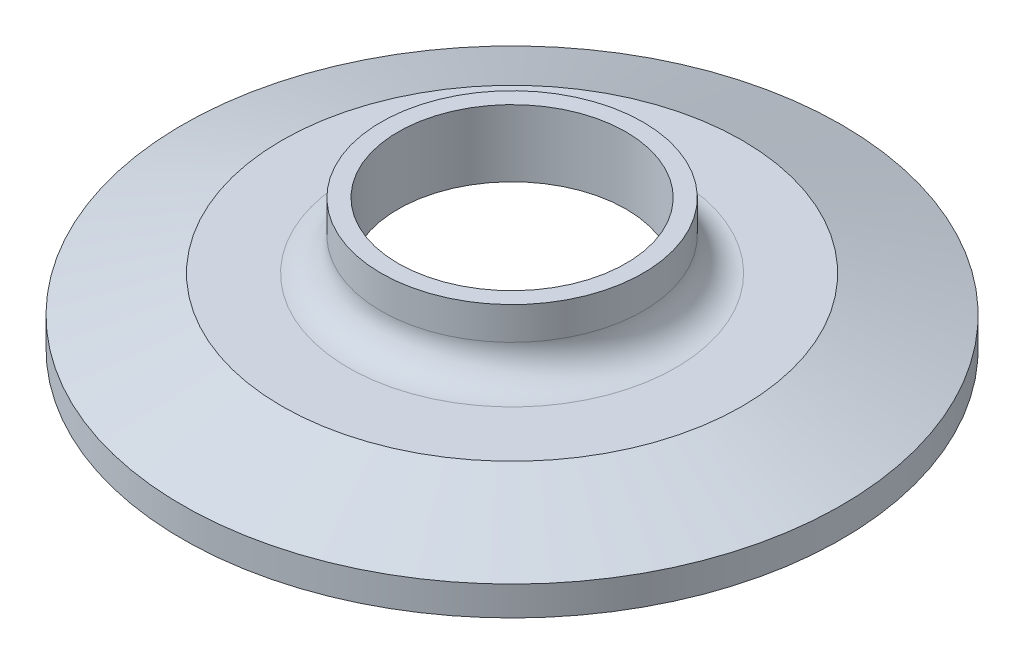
ISO-10303-21;
HEADER;
FILE_DESCRIPTION(('STEP AP214'),'2;1');
FILE_NAME('part.step','',(''),(''),'','','');
FILE_SCHEMA(('AUTOMOTIVE_DESIGN { 1 0 10303 214 1 1 1 1 }'));
ENDSEC;
DATA;
#1=APPLICATION_CONTEXT('core data for automotive mechanical design processes');
#2=APPLICATION_PROTOCOL_DEFINITION('international standard','automotive_design',2000,#1);
#3=PRODUCT_CONTEXT('',#1,'mechanical');
#4=PRODUCT('Part','Part','',(#3));
#5=PRODUCT_RELATED_PRODUCT_CATEGORY('part','',(#4));
#6=PRODUCT_DEFINITION_FORMATION('','',#4);
#7=PRODUCT_DEFINITION_CONTEXT('part definition',#1,'design');
#8=PRODUCT_DEFINITION('design','',#6,#7);
#9=PRODUCT_DEFINITION_SHAPE('','',#8);
#10=(LENGTH_UNIT() NAMED_UNIT(*) SI_UNIT(.MILLI.,.METRE.));
#11=(NAMED_UNIT(*) PLANE_ANGLE_UNIT() SI_UNIT($,.RADIAN.));
#12=(NAMED_UNIT(*) SI_UNIT($,.STERADIAN.) SOLID_ANGLE_UNIT());
#13=UNCERTAINTY_MEASURE_WITH_UNIT(LENGTH_MEASURE(1.E-05),#10,'distance_accuracy_value','');
#14=(GEOMETRIC_REPRESENTATION_CONTEXT(3) GLOBAL_UNCERTAINTY_ASSIGNED_CONTEXT((#13)) GLOBAL_UNIT_ASSIGNED_CONTEXT((#10,
#11,#12)) REPRESENTATION_CONTEXT('',''));
#15=CARTESIAN_POINT('',(0.,0.,0.));
#16=DIRECTION('',(0.,0.,1.));
#17=DIRECTION('',(1.,0.,0.));
#18=AXIS2_PLACEMENT_3D('',#15,#16,#17);
#19=CARTESIAN_POINT('',(-11.049,12.7,0.));
#20=DIRECTION('',(0.,-1.,0.));
#21=DIRECTION('',(0.,0.,-1.));
#22=AXIS2_PLACEMENT_3D('',#19,#20,#21);
#23=PLANE('',#22);
#24=CARTESIAN_POINT('',(0.,12.7,0.));
#25=DIRECTION('',(0.,-1.,0.));
#26=DIRECTION('',(0.,0.,-1.));
#27=AXIS2_PLACEMENT_3D('',#24,#25,#26);
#28=CIRCLE('',#27,12.7);
#29=CARTESIAN_POINT('',(0.,12.7,-12.7));
#30=VERTEX_POINT('',#29);
#31=EDGE_CURVE('E12',#30,#30,#28,.T.);
#32=ORIENTED_EDGE('',*,*,#31,.F.);
#33=EDGE_LOOP('',(#32));
#34=FACE_BOUND('',#33,.T.);
#35=CARTESIAN_POINT('',(0.,12.7,0.));
#36=DIRECTION('',(0.,-1.,0.));
#37=DIRECTION('',(0.,0.,-1.));
#38=AXIS2_PLACEMENT_3D('',#35,#36,#37);
#39=CIRCLE('',#38,11.049);
#40=CARTESIAN_POINT('',(0.,12.7,-11.049));
#41=VERTEX_POINT('',#40);
#42=EDGE_CURVE('E87',#41,#41,#39,.T.);
#43=ORIENTED_EDGE('',*,*,#42,.T.);
#44=EDGE_LOOP('',(#43));
#45=FACE_BOUND('',#44,.T.);
#46=ADVANCED_FACE('F38',(#34,#45),#23,.F.);
#47=CARTESIAN_POINT('',(0.,0.,0.));
#48=DIRECTION('',(0.,-1.,0.));
#49=DIRECTION('',(0.,0.,-1.));
#50=AXIS2_PLACEMENT_3D('',#47,#48,#49);
#51=CYLINDRICAL_SURFACE('',#50,12.7);
#52=CARTESIAN_POINT('',(0.,9.52500000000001,0.));
#53=DIRECTION('',(0.,-1.,0.));
#54=DIRECTION('',(0.,0.,-1.));
#55=AXIS2_PLACEMENT_3D('',#52,#53,#54);
#56=CIRCLE('',#55,12.7);
#57=CARTESIAN_POINT('',(0.,9.525,-12.7));
#58=VERTEX_POINT('',#57);
#59=EDGE_CURVE('E44',#58,#58,#56,.T.);
#60=ORIENTED_EDGE('',*,*,#59,.F.);
#61=EDGE_LOOP('',(#60));
#62=FACE_BOUND('',#61,.T.);
#63=ORIENTED_EDGE('',*,*,#31,.T.);
#64=EDGE_LOOP('',(#63));
#65=FACE_BOUND('',#64,.T.);
#66=ADVANCED_FACE('F166',(#62,#65),#51,.T.);
#67=CARTESIAN_POINT('',(0.,9.52500000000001,0.));
#68=DIRECTION('',(0.,-1.,0.));
#69=DIRECTION('',(0.,0.,-1.));
#70=AXIS2_PLACEMENT_3D('',#67,#68,#69);
#71=TOROIDAL_SURFACE('',#70,15.875,3.175);
#72=CARTESIAN_POINT('',(0.,6.34999999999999,0.));
#73=DIRECTION('',(0.,-1.,0.));
#74=DIRECTION('',(0.,0.,-1.));
#75=AXIS2_PLACEMENT_3D('',#72,#73,#74);
#76=CIRCLE('',#75,15.875);
#77=CARTESIAN_POINT('',(0.,6.34999999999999,-15.875));
#78=VERTEX_POINT('',#77);
#79=EDGE_CURVE('E48',#78,#78,#76,.T.);
#80=ORIENTED_EDGE('',*,*,#79,.F.);
#81=EDGE_LOOP('',(#80));
#82=FACE_BOUND('',#81,.T.);
#83=ORIENTED_EDGE('',*,*,#59,.T.);
#84=EDGE_LOOP('',(#83));
#85=FACE_BOUND('',#84,.T.);
#86=ADVANCED_FACE('F161',(#82,#85),#71,.F.);
#87=CARTESIAN_POINT('',(-15.875,6.34999999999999,0.));
#88=DIRECTION('',(0.,-1.,0.));
#89=DIRECTION('',(0.,0.,-1.));
#90=AXIS2_PLACEMENT_3D('',#87,#88,#89);
#91=PLANE('',#90);
#92=CARTESIAN_POINT('',(0.,6.34999999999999,0.));
#93=DIRECTION('',(0.,-1.,0.));
#94=DIRECTION('',(0.,0.,-1.));
#95=AXIS2_PLACEMENT_3D('',#92,#93,#94);
#96=CIRCLE('',#95,22.3227421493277);
#97=CARTESIAN_POINT('',(0.,6.34999999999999,-22.3227421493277));
#98=VERTEX_POINT('',#97);
#99=EDGE_CURVE('E52',#98,#98,#96,.T.);
#100=ORIENTED_EDGE('',*,*,#99,.F.);
#101=EDGE_LOOP('',(#100));
#102=FACE_BOUND('',#101,.T.);
#103=ORIENTED_EDGE('',*,*,#79,.T.);
#104=EDGE_LOOP('',(#103));
#105=FACE_BOUND('',#104,.T.);
#106=ADVANCED_FACE('F155',(#102,#105),#91,.F.);
#107=CARTESIAN_POINT('',(0.,6.34999999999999,0.));
#108=DIRECTION('',(0.,-1.,0.));
#109=DIRECTION('',(0.,0.,-1.));
#110=AXIS2_PLACEMENT_3D('',#107,#108,#109);
#111=CONICAL_SURFACE('',#110,22.3227421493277,1.22173047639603);
#112=CARTESIAN_POINT('',(0.,2.84479999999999,0.));
#113=DIRECTION('',(0.,-1.,0.));
#114=DIRECTION('',(0.,0.,-1.));
#115=AXIS2_PLACEMENT_3D('',#112,#113,#114);
#116=CIRCLE('',#115,31.9532);
#117=CARTESIAN_POINT('',(0.,2.84479999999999,-31.9532));
#118=VERTEX_POINT('',#117);
#119=EDGE_CURVE('E57',#118,#118,#116,.T.);
#120=ORIENTED_EDGE('',*,*,#119,.F.);
#121=EDGE_LOOP('',(#120));
#122=FACE_BOUND('',#121,.T.);
#123=ORIENTED_EDGE('',*,*,#99,.T.);
#124=EDGE_LOOP('',(#123));
#125=FACE_BOUND('',#124,.T.);
#126=ADVANCED_FACE('F149',(#122,#125),#111,.T.);
#127=CARTESIAN_POINT('',(0.,0.,0.));
#128=DIRECTION('',(0.,-1.,0.));
#129=DIRECTION('',(0.,0.,-1.));
#130=AXIS2_PLACEMENT_3D('',#127,#128,#129);
#131=CYLINDRICAL_SURFACE('',#130,31.9532);
#132=CARTESIAN_POINT('',(0.,0.,0.));
#133=DIRECTION('',(0.,-1.,0.));
#134=DIRECTION('',(0.,0.,-1.));
#135=AXIS2_PLACEMENT_3D('',#132,#133,#134);
#136=CIRCLE('',#135,31.9532);
#137=CARTESIAN_POINT('',(0.,0.,-31.9532));
#138=VERTEX_POINT('',#137);
#139=EDGE_CURVE('E60',#138,#138,#136,.T.);
#140=ORIENTED_EDGE('',*,*,#139,.F.);
#141=EDGE_LOOP('',(#140));
#142=FACE_BOUND('',#141,.T.);
#143=ORIENTED_EDGE('',*,*,#119,.T.);
#144=EDGE_LOOP('',(#143));
#145=FACE_BOUND('',#144,.T.);
#146=ADVANCED_FACE('F143',(#142,#145),#131,.T.);
#147=CARTESIAN_POINT('',(0.,0.,0.));
#148=DIRECTION('',(0.,-1.,0.));
#149=DIRECTION('',(0.,0.,-1.));
#150=AXIS2_PLACEMENT_3D('',#147,#148,#149);
#151=CONICAL_SURFACE('',#150,31.9532,1.56939586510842);
#152=CARTESIAN_POINT('',(0.,0.0025124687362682,0.));
#153=DIRECTION('',(0.,-1.,0.));
#154=DIRECTION('',(0.,0.,-1.));
#155=AXIS2_PLACEMENT_3D('',#152,#153,#154);
#156=CIRCLE('',#155,30.1591722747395);
#157=CARTESIAN_POINT('',(0.,0.00251246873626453,-30.1591722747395));
#158=VERTEX_POINT('',#157);
#159=EDGE_CURVE('E63',#158,#158,#156,.T.);
#160=ORIENTED_EDGE('',*,*,#159,.F.);
#161=EDGE_LOOP('',(#160));
#162=FACE_BOUND('',#161,.T.);
#163=ORIENTED_EDGE('',*,*,#139,.T.);
#164=EDGE_LOOP('',(#163));
#165=FACE_BOUND('',#164,.T.);
#166=ADVANCED_FACE('F137',(#162,#165),#151,.F.);
#167=CARTESIAN_POINT('',(0.,0.789912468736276,0.));
#168=DIRECTION('',(0.,-1.,0.));
#169=DIRECTION('',(0.,0.,-1.));
#170=AXIS2_PLACEMENT_3D('',#167,#168,#169);
#171=TOROIDAL_SURFACE('',#170,30.1591722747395,0.787400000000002);
#172=CARTESIAN_POINT('',(0.,0.482250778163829,0.));
#173=DIRECTION('',(0.,-1.,0.));
#174=DIRECTION('',(0.,0.,-1.));
#175=AXIS2_PLACEMENT_3D('',#172,#173,#174);
#176=CIRCLE('',#175,29.434366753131);
#177=CARTESIAN_POINT('',(0.,0.482250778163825,-29.434366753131));
#178=VERTEX_POINT('',#177);
#179=EDGE_CURVE('E66',#178,#178,#176,.T.);
#180=ORIENTED_EDGE('',*,*,#179,.F.);
#181=EDGE_LOOP('',(#180));
#182=FACE_BOUND('',#181,.T.);
#183=ORIENTED_EDGE('',*,*,#159,.T.);
#184=EDGE_LOOP('',(#183));
#185=FACE_BOUND('',#184,.T.);
#186=ADVANCED_FACE('F131',(#182,#185),#171,.T.);
#187=CARTESIAN_POINT('',(0.,0.482250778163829,0.));
#188=DIRECTION('',(0.,-1.,0.));
#189=DIRECTION('',(0.,0.,-1.));
#190=AXIS2_PLACEMENT_3D('',#187,#188,#189);
#191=CONICAL_SURFACE('',#190,29.434366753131,0.401425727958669);
#192=CARTESIAN_POINT('',(0.,0.875367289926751,0.));
#193=DIRECTION('',(0.,-1.,0.));
#194=DIRECTION('',(0.,0.,-1.));
#195=AXIS2_PLACEMENT_3D('',#192,#193,#194);
#196=CIRCLE('',#195,29.2674986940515);
#197=CARTESIAN_POINT('',(0.,0.875367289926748,-29.2674986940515));
#198=VERTEX_POINT('',#197);
#199=EDGE_CURVE('E69',#198,#198,#196,.T.);
#200=ORIENTED_EDGE('',*,*,#199,.F.);
#201=EDGE_LOOP('',(#200));
#202=FACE_BOUND('',#201,.T.);
#203=ORIENTED_EDGE('',*,*,#179,.T.);
#204=EDGE_LOOP('',(#203));
#205=FACE_BOUND('',#204,.T.);
#206=ADVANCED_FACE('F125',(#202,#205),#191,.F.);
#207=CARTESIAN_POINT('',(0.,0.408912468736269,0.));
#208=DIRECTION('',(0.,-1.,0.));
#209=DIRECTION('',(0.,0.,-1.));
#210=AXIS2_PLACEMENT_3D('',#207,#208,#209);
#211=TOROIDAL_SURFACE('',#210,28.1686,1.1938);
#212=CARTESIAN_POINT('',(0.,0.875367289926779,0.));
#213=DIRECTION('',(0.,-1.,0.));
#214=DIRECTION('',(0.,0.,-1.));
#215=AXIS2_PLACEMENT_3D('',#212,#213,#214);
#216=CIRCLE('',#215,27.0697013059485);
#217=CARTESIAN_POINT('',(0.,0.875367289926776,-27.0697013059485));
#218=VERTEX_POINT('',#217);
#219=EDGE_CURVE('E72',#218,#218,#216,.T.);
#220=ORIENTED_EDGE('',*,*,#219,.F.);
#221=EDGE_LOOP('',(#220));
#222=FACE_BOUND('',#221,.T.);
#223=ORIENTED_EDGE('',*,*,#199,.T.);
#224=EDGE_LOOP('',(#223));
#225=FACE_BOUND('',#224,.T.);
#226=ADVANCED_FACE('F119',(#222,#225),#211,.F.);
#227=CARTESIAN_POINT('',(0.,0.875367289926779,0.));
#228=DIRECTION('',(0.,1.,0.));
#229=DIRECTION('',(0.,0.,1.));
#230=AXIS2_PLACEMENT_3D('',#227,#228,#229);
#231=CONICAL_SURFACE('',#230,27.0697013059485,0.401425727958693);
#232=CARTESIAN_POINT('',(0.,0.482250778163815,0.));
#233=DIRECTION('',(0.,-1.,0.));
#234=DIRECTION('',(0.,0.,-1.));
#235=AXIS2_PLACEMENT_3D('',#232,#233,#234);
#236=CIRCLE('',#235,26.9028332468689);
#237=CARTESIAN_POINT('',(0.,0.482250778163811,-26.9028332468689));
#238=VERTEX_POINT('',#237);
#239=EDGE_CURVE('E75',#238,#238,#236,.T.);
#240=ORIENTED_EDGE('',*,*,#239,.F.);
#241=EDGE_LOOP('',(#240));
#242=FACE_BOUND('',#241,.T.);
#243=ORIENTED_EDGE('',*,*,#219,.T.);
#244=EDGE_LOOP('',(#243));
#245=FACE_BOUND('',#244,.T.);
#246=ADVANCED_FACE('F113',(#242,#245),#231,.T.);
#247=CARTESIAN_POINT('',(0.,0.789912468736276,0.));
#248=DIRECTION('',(0.,-1.,0.));
#249=DIRECTION('',(0.,0.,-1.));
#250=AXIS2_PLACEMENT_3D('',#247,#248,#249);
#251=TOROIDAL_SURFACE('',#250,26.1780277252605,0.787400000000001);
#252=CARTESIAN_POINT('',(0.,0.0025124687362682,0.));
#253=DIRECTION('',(0.,-1.,0.));
#254=DIRECTION('',(0.,0.,-1.));
#255=AXIS2_PLACEMENT_3D('',#252,#253,#254);
#256=CIRCLE('',#255,26.1780277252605);
#257=CARTESIAN_POINT('',(0.,0.00251246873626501,-26.1780277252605));
#258=VERTEX_POINT('',#257);
#259=EDGE_CURVE('E78',#258,#258,#256,.T.);
#260=ORIENTED_EDGE('',*,*,#259,.F.);
#261=EDGE_LOOP('',(#260));
#262=FACE_BOUND('',#261,.T.);
#263=ORIENTED_EDGE('',*,*,#239,.T.);
#264=EDGE_LOOP('',(#263));
#265=FACE_BOUND('',#264,.T.);
#266=ADVANCED_FACE('F107',(#262,#265),#251,.T.);
#267=CARTESIAN_POINT('',(0.,0.0025124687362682,0.));
#268=DIRECTION('',(0.,1.,0.));
#269=DIRECTION('',(0.,0.,1.));
#270=AXIS2_PLACEMENT_3D('',#267,#268,#269);
#271=CONICAL_SURFACE('',#270,26.1780277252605,1.56976197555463);
#272=CARTESIAN_POINT('',(0.,0.,0.));
#273=DIRECTION('',(0.,-1.,0.));
#274=DIRECTION('',(0.,0.,-1.));
#275=AXIS2_PLACEMENT_3D('',#272,#273,#274);
#276=CIRCLE('',#275,23.749);
#277=CARTESIAN_POINT('',(0.,0.,-23.749));
#278=VERTEX_POINT('',#277);
#279=EDGE_CURVE('E81',#278,#278,#276,.T.);
#280=ORIENTED_EDGE('',*,*,#279,.F.);
#281=EDGE_LOOP('',(#280));
#282=FACE_BOUND('',#281,.T.);
#283=ORIENTED_EDGE('',*,*,#259,.T.);
#284=EDGE_LOOP('',(#283));
#285=FACE_BOUND('',#284,.T.);
#286=ADVANCED_FACE('F101',(#282,#285),#271,.T.);
#287=CARTESIAN_POINT('',(0.,0.,0.));
#288=DIRECTION('',(0.,-1.,0.));
#289=DIRECTION('',(0.,0.,-1.));
#290=AXIS2_PLACEMENT_3D('',#287,#288,#289);
#291=CONICAL_SURFACE('',#290,23.749,1.11543992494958);
#292=CARTESIAN_POINT('',(0.,6.21891749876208,0.));
#293=DIRECTION('',(0.,-1.,0.));
#294=DIRECTION('',(0.,0.,-1.));
#295=AXIS2_PLACEMENT_3D('',#292,#293,#294);
#296=CIRCLE('',#295,11.049);
#297=CARTESIAN_POINT('',(0.,6.21891749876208,-11.049));
#298=VERTEX_POINT('',#297);
#299=EDGE_CURVE('E84',#298,#298,#296,.T.);
#300=ORIENTED_EDGE('',*,*,#299,.F.);
#301=EDGE_LOOP('',(#300));
#302=FACE_BOUND('',#301,.T.);
#303=ORIENTED_EDGE('',*,*,#279,.T.);
#304=EDGE_LOOP('',(#303));
#305=FACE_BOUND('',#304,.T.);
#306=ADVANCED_FACE('F95',(#302,#305),#291,.F.);
#307=CARTESIAN_POINT('',(0.,0.,0.));
#308=DIRECTION('',(0.,-1.,0.));
#309=DIRECTION('',(0.,0.,-1.));
#310=AXIS2_PLACEMENT_3D('',#307,#308,#309);
#311=CYLINDRICAL_SURFACE('',#310,11.049);
#312=ORIENTED_EDGE('',*,*,#42,.F.);
#313=EDGE_LOOP('',(#312));
#314=FACE_BOUND('',#313,.T.);
#315=ORIENTED_EDGE('',*,*,#299,.T.);
#316=EDGE_LOOP('',(#315));
#317=FACE_BOUND('',#316,.T.);
#318=ADVANCED_FACE('F92',(#314,#317),#311,.F.);
#319=CLOSED_SHELL('',(#46,#66,#86,#106,#126,#146,#166,#186,#206,#226,#246,#266,#286,#306,#318));
#320=MANIFOLD_SOLID_BREP('B2',#319);
#321=ADVANCED_BREP_SHAPE_REPRESENTATION('',(#18,#320),#14);
#322=SHAPE_DEFINITION_REPRESENTATION(#9,#321);
ENDSEC;
END-ISO-10303-21;
